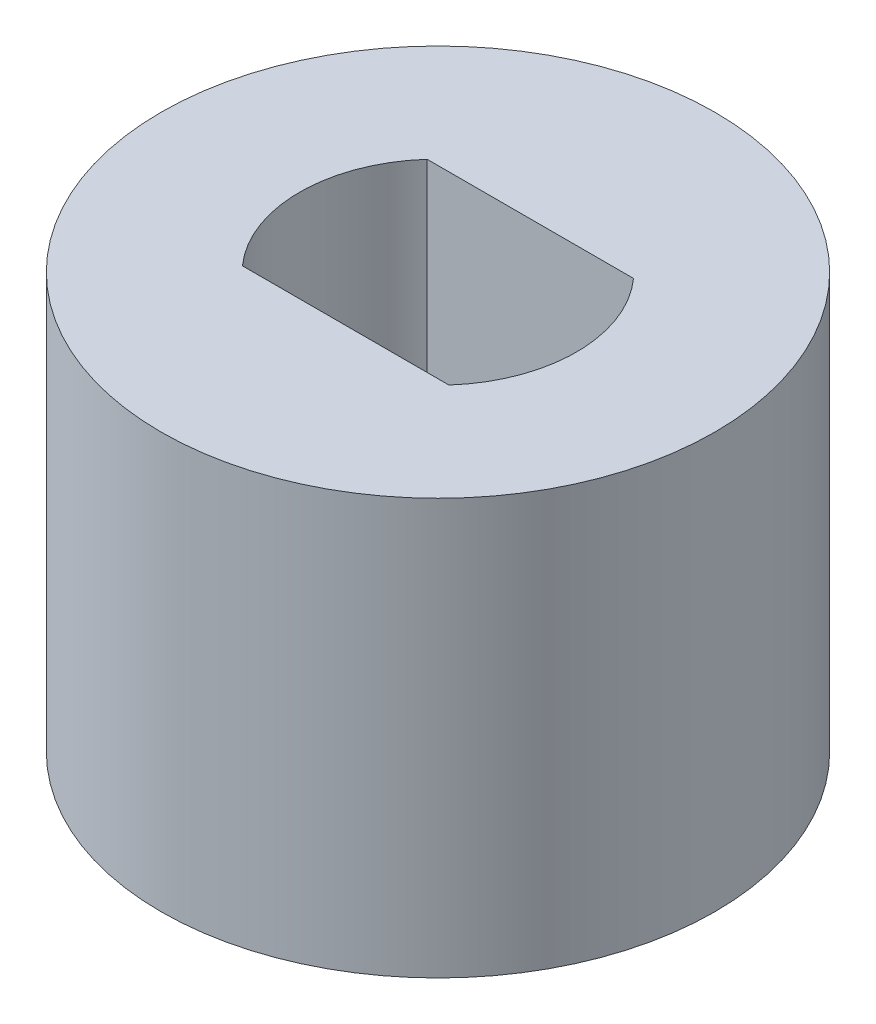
ISO-10303-21;
HEADER;
FILE_DESCRIPTION(('STEP AP214'),'2;1');
FILE_NAME('part.step','',(''),(''),'','','');
FILE_SCHEMA(('AUTOMOTIVE_DESIGN { 1 0 10303 214 1 1 1 1 }'));
ENDSEC;
DATA;
#1=APPLICATION_CONTEXT('core data for automotive mechanical design processes');
#2=APPLICATION_PROTOCOL_DEFINITION('international standard','automotive_design',2000,#1);
#3=PRODUCT_CONTEXT('',#1,'mechanical');
#4=PRODUCT('Part','Part','',(#3));
#5=PRODUCT_RELATED_PRODUCT_CATEGORY('part','',(#4));
#6=PRODUCT_DEFINITION_FORMATION('','',#4);
#7=PRODUCT_DEFINITION_CONTEXT('part definition',#1,'design');
#8=PRODUCT_DEFINITION('design','',#6,#7);
#9=PRODUCT_DEFINITION_SHAPE('','',#8);
#10=(LENGTH_UNIT() NAMED_UNIT(*) SI_UNIT(.MILLI.,.METRE.));
#11=(NAMED_UNIT(*) PLANE_ANGLE_UNIT() SI_UNIT($,.RADIAN.));
#12=(NAMED_UNIT(*) SI_UNIT($,.STERADIAN.) SOLID_ANGLE_UNIT());
#13=UNCERTAINTY_MEASURE_WITH_UNIT(LENGTH_MEASURE(1.E-05),#10,'distance_accuracy_value','');
#14=(GEOMETRIC_REPRESENTATION_CONTEXT(3) GLOBAL_UNCERTAINTY_ASSIGNED_CONTEXT((#13)) GLOBAL_UNIT_ASSIGNED_CONTEXT((#10,
#11,#12)) REPRESENTATION_CONTEXT('',''));
#15=CARTESIAN_POINT('',(0.,0.,0.));
#16=DIRECTION('',(0.,0.,1.));
#17=DIRECTION('',(1.,0.,0.));
#18=AXIS2_PLACEMENT_3D('',#15,#16,#17);
#19=CARTESIAN_POINT('',(0.,7.,0.));
#20=DIRECTION('',(0.,-1.,0.));
#21=DIRECTION('',(0.,0.,-1.));
#22=AXIS2_PLACEMENT_3D('',#19,#20,#21);
#23=CYLINDRICAL_SURFACE('',#22,3.);
#24=CARTESIAN_POINT('',(0.,0.,0.));
#25=DIRECTION('',(0.,1.,0.));
#26=DIRECTION('',(0.,0.,1.));
#27=AXIS2_PLACEMENT_3D('',#24,#25,#26);
#28=CIRCLE('',#27,3.);
#29=CARTESIAN_POINT('',(2.23606797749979,0.,2.));
#30=VERTEX_POINT('',#29);
#31=CARTESIAN_POINT('',(2.23606797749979,0.,-2.));
#32=VERTEX_POINT('',#31);
#33=EDGE_CURVE('E81',#30,#32,#28,.T.);
#34=ORIENTED_EDGE('',*,*,#33,.F.);
#35=DIRECTION('',(0.,-1.,0.));
#36=VECTOR('',#35,1.);
#37=CARTESIAN_POINT('',(2.23606797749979,7.,2.));
#38=LINE('',#37,#36);
#39=CARTESIAN_POINT('',(2.23606797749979,7.,2.));
#40=VERTEX_POINT('',#39);
#41=EDGE_CURVE('E11',#40,#30,#38,.T.);
#42=ORIENTED_EDGE('',*,*,#41,.F.);
#43=CARTESIAN_POINT('',(0.,7.,0.));
#44=DIRECTION('',(0.,1.,0.));
#45=DIRECTION('',(0.,0.,1.));
#46=AXIS2_PLACEMENT_3D('',#43,#44,#45);
#47=CIRCLE('',#46,3.);
#48=CARTESIAN_POINT('',(2.23606797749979,7.,-2.));
#49=VERTEX_POINT('',#48);
#50=EDGE_CURVE('E84',#40,#49,#47,.T.);
#51=ORIENTED_EDGE('',*,*,#50,.T.);
#52=DIRECTION('',(0.,-1.,0.));
#53=VECTOR('',#52,1.);
#54=CARTESIAN_POINT('',(2.23606797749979,7.,-2.));
#55=LINE('',#54,#53);
#56=EDGE_CURVE('E90',#49,#32,#55,.T.);
#57=ORIENTED_EDGE('',*,*,#56,.T.);
#58=EDGE_LOOP('',(#34,#42,#51,#57));
#59=FACE_BOUND('',#58,.T.);
#60=ADVANCED_FACE('F36',(#59),#23,.F.);
#61=CARTESIAN_POINT('',(0.,7.,2.));
#62=DIRECTION('',(0.,0.,1.));
#63=DIRECTION('',(1.,0.,0.));
#64=AXIS2_PLACEMENT_3D('',#61,#62,#63);
#65=PLANE('',#64);
#66=DIRECTION('',(-1.,0.,0.));
#67=VECTOR('',#66,1.);
#68=CARTESIAN_POINT('',(0.,0.,2.));
#69=LINE('',#68,#67);
#70=CARTESIAN_POINT('',(-2.23606797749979,0.,2.));
#71=VERTEX_POINT('',#70);
#72=EDGE_CURVE('E95',#30,#71,#69,.T.);
#73=ORIENTED_EDGE('',*,*,#72,.T.);
#74=DIRECTION('',(0.,-1.,0.));
#75=VECTOR('',#74,1.);
#76=CARTESIAN_POINT('',(-2.23606797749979,7.,2.));
#77=LINE('',#76,#75);
#78=CARTESIAN_POINT('',(-2.23606797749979,7.,2.));
#79=VERTEX_POINT('',#78);
#80=EDGE_CURVE('E45',#79,#71,#77,.T.);
#81=ORIENTED_EDGE('',*,*,#80,.F.);
#82=DIRECTION('',(-1.,0.,0.));
#83=VECTOR('',#82,1.);
#84=CARTESIAN_POINT('',(0.,7.,2.));
#85=LINE('',#84,#83);
#86=EDGE_CURVE('E107',#40,#79,#85,.T.);
#87=ORIENTED_EDGE('',*,*,#86,.F.);
#88=ORIENTED_EDGE('',*,*,#41,.T.);
#89=EDGE_LOOP('',(#73,#81,#87,#88));
#90=FACE_BOUND('',#89,.T.);
#91=ADVANCED_FACE('F38',(#90),#65,.F.);
#92=CARTESIAN_POINT('',(-2.23606797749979,0.,-2.));
#93=VERTEX_POINT('',#92);
#94=EDGE_CURVE('E78',#93,#71,#28,.T.);
#95=ORIENTED_EDGE('',*,*,#94,.F.);
#96=DIRECTION('',(0.,-1.,0.));
#97=VECTOR('',#96,1.);
#98=CARTESIAN_POINT('',(-2.23606797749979,7.,-2.));
#99=LINE('',#98,#97);
#100=CARTESIAN_POINT('',(-2.23606797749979,7.,-2.));
#101=VERTEX_POINT('',#100);
#102=EDGE_CURVE('E86',#101,#93,#99,.T.);
#103=ORIENTED_EDGE('',*,*,#102,.F.);
#104=EDGE_CURVE('E108',#101,#79,#47,.T.);
#105=ORIENTED_EDGE('',*,*,#104,.T.);
#106=ORIENTED_EDGE('',*,*,#80,.T.);
#107=EDGE_LOOP('',(#95,#103,#105,#106));
#108=FACE_BOUND('',#107,.T.);
#109=ADVANCED_FACE('F92',(#108),#23,.F.);
#110=CARTESIAN_POINT('',(0.,7.,-2.));
#111=DIRECTION('',(0.,0.,-1.));
#112=DIRECTION('',(-1.,0.,0.));
#113=AXIS2_PLACEMENT_3D('',#110,#111,#112);
#114=PLANE('',#113);
#115=DIRECTION('',(1.,0.,0.));
#116=VECTOR('',#115,1.);
#117=CARTESIAN_POINT('',(0.,0.,-2.));
#118=LINE('',#117,#116);
#119=EDGE_CURVE('E74',#93,#32,#118,.T.);
#120=ORIENTED_EDGE('',*,*,#119,.T.);
#121=ORIENTED_EDGE('',*,*,#56,.F.);
#122=DIRECTION('',(1.,0.,0.));
#123=VECTOR('',#122,1.);
#124=CARTESIAN_POINT('',(0.,7.,-2.));
#125=LINE('',#124,#123);
#126=EDGE_CURVE('E52',#101,#49,#125,.T.);
#127=ORIENTED_EDGE('',*,*,#126,.F.);
#128=ORIENTED_EDGE('',*,*,#102,.T.);
#129=EDGE_LOOP('',(#120,#121,#127,#128));
#130=FACE_BOUND('',#129,.T.);
#131=ADVANCED_FACE('F87',(#130),#114,.F.);
#132=CARTESIAN_POINT('',(0.,7.,0.));
#133=DIRECTION('',(0.,-1.,0.));
#134=DIRECTION('',(0.,0.,-1.));
#135=AXIS2_PLACEMENT_3D('',#132,#133,#134);
#136=CYLINDRICAL_SURFACE('',#135,6.);
#137=CARTESIAN_POINT('',(0.,7.,0.));
#138=DIRECTION('',(0.,1.,0.));
#139=DIRECTION('',(0.,0.,1.));
#140=AXIS2_PLACEMENT_3D('',#137,#138,#139);
#141=CIRCLE('',#140,6.);
#142=CARTESIAN_POINT('',(0.,7.,6.));
#143=VERTEX_POINT('',#142);
#144=EDGE_CURVE('E110',#143,#143,#141,.T.);
#145=ORIENTED_EDGE('',*,*,#144,.F.);
#146=EDGE_LOOP('',(#145));
#147=FACE_BOUND('',#146,.T.);
#148=CARTESIAN_POINT('',(0.,-2.,0.));
#149=DIRECTION('',(0.,-1.,0.));
#150=DIRECTION('',(0.,0.,-1.));
#151=AXIS2_PLACEMENT_3D('',#148,#149,#150);
#152=CIRCLE('',#151,6.);
#153=CARTESIAN_POINT('',(0.,-2.,-6.));
#154=VERTEX_POINT('',#153);
#155=EDGE_CURVE('E99',#154,#154,#152,.T.);
#156=ORIENTED_EDGE('',*,*,#155,.F.);
#157=EDGE_LOOP('',(#156));
#158=FACE_BOUND('',#157,.T.);
#159=ADVANCED_FACE('F129',(#147,#158),#136,.T.);
#160=CARTESIAN_POINT('',(0.,7.,0.));
#161=DIRECTION('',(0.,1.,0.));
#162=DIRECTION('',(0.,0.,1.));
#163=AXIS2_PLACEMENT_3D('',#160,#161,#162);
#164=PLANE('',#163);
#165=ORIENTED_EDGE('',*,*,#50,.F.);
#166=ORIENTED_EDGE('',*,*,#86,.T.);
#167=ORIENTED_EDGE('',*,*,#104,.F.);
#168=ORIENTED_EDGE('',*,*,#126,.T.);
#169=EDGE_LOOP('',(#165,#166,#167,#168));
#170=FACE_BOUND('',#169,.T.);
#171=ORIENTED_EDGE('',*,*,#144,.T.);
#172=EDGE_LOOP('',(#171));
#173=FACE_BOUND('',#172,.T.);
#174=ADVANCED_FACE('F117',(#170,#173),#164,.T.);
#175=CARTESIAN_POINT('',(0.,-2.,0.));
#176=DIRECTION('',(0.,-1.,0.));
#177=DIRECTION('',(0.,0.,-1.));
#178=AXIS2_PLACEMENT_3D('',#175,#176,#177);
#179=PLANE('',#178);
#180=ORIENTED_EDGE('',*,*,#155,.T.);
#181=EDGE_LOOP('',(#180));
#182=FACE_BOUND('',#181,.T.);
#183=ADVANCED_FACE('F135',(#182),#179,.T.);
#184=CARTESIAN_POINT('',(0.,0.,0.));
#185=DIRECTION('',(0.,-1.,0.));
#186=DIRECTION('',(0.,0.,-1.));
#187=AXIS2_PLACEMENT_3D('',#184,#185,#186);
#188=PLANE('',#187);
#189=ORIENTED_EDGE('',*,*,#33,.T.);
#190=ORIENTED_EDGE('',*,*,#119,.F.);
#191=ORIENTED_EDGE('',*,*,#94,.T.);
#192=ORIENTED_EDGE('',*,*,#72,.F.);
#193=EDGE_LOOP('',(#189,#190,#191,#192));
#194=FACE_BOUND('',#193,.T.);
#195=ADVANCED_FACE('F76',(#194),#188,.F.);
#196=CLOSED_SHELL('',(#60,#91,#109,#131,#159,#174,#183,#195));
#197=MANIFOLD_SOLID_BREP('B2',#196);
#198=ADVANCED_BREP_SHAPE_REPRESENTATION('',(#18,#197),#14);
#199=SHAPE_DEFINITION_REPRESENTATION(#9,#198);
ENDSEC;
END-ISO-10303-21;
